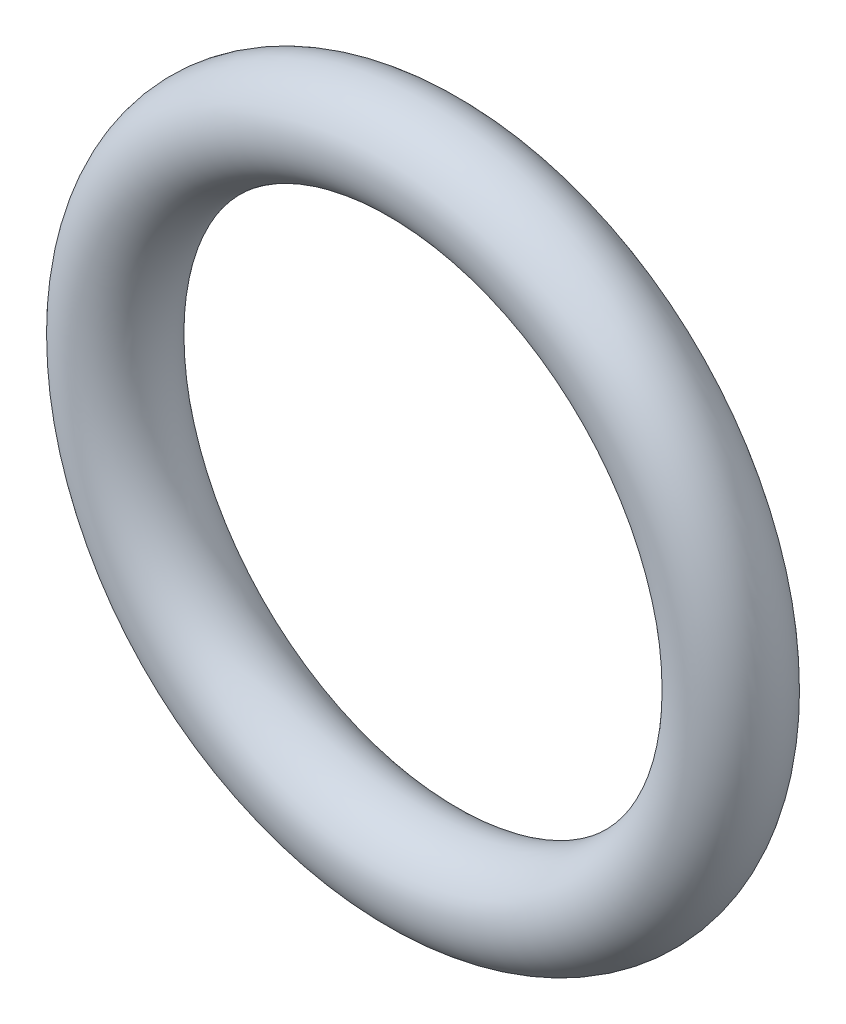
ISO-10303-21;
HEADER;
FILE_DESCRIPTION(('STEP AP214'),'2;1');
FILE_NAME('part.step','',(''),(''),'','','');
FILE_SCHEMA(('AUTOMOTIVE_DESIGN { 1 0 10303 214 1 1 1 1 }'));
ENDSEC;
DATA;
#1=APPLICATION_CONTEXT('core data for automotive mechanical design processes');
#2=APPLICATION_PROTOCOL_DEFINITION('international standard','automotive_design',2000,#1);
#3=PRODUCT_CONTEXT('',#1,'mechanical');
#4=PRODUCT('Part','Part','',(#3));
#5=PRODUCT_RELATED_PRODUCT_CATEGORY('part','',(#4));
#6=PRODUCT_DEFINITION_FORMATION('','',#4);
#7=PRODUCT_DEFINITION_CONTEXT('part definition',#1,'design');
#8=PRODUCT_DEFINITION('design','',#6,#7);
#9=PRODUCT_DEFINITION_SHAPE('','',#8);
#10=(LENGTH_UNIT() NAMED_UNIT(*) SI_UNIT(.MILLI.,.METRE.));
#11=(NAMED_UNIT(*) PLANE_ANGLE_UNIT() SI_UNIT($,.RADIAN.));
#12=(NAMED_UNIT(*) SI_UNIT($,.STERADIAN.) SOLID_ANGLE_UNIT());
#13=UNCERTAINTY_MEASURE_WITH_UNIT(LENGTH_MEASURE(1.E-05),#10,'distance_accuracy_value','');
#14=(GEOMETRIC_REPRESENTATION_CONTEXT(3) GLOBAL_UNCERTAINTY_ASSIGNED_CONTEXT((#13)) GLOBAL_UNIT_ASSIGNED_CONTEXT((#10,
#11,#12)) REPRESENTATION_CONTEXT('',''));
#15=CARTESIAN_POINT('',(0.,0.,0.));
#16=DIRECTION('',(0.,0.,1.));
#17=DIRECTION('',(1.,0.,0.));
#18=AXIS2_PLACEMENT_3D('',#15,#16,#17);
#19=CARTESIAN_POINT('',(0.,0.,-49.25));
#20=DIRECTION('',(0.,0.,1.));
#21=DIRECTION('',(1.,0.,0.));
#22=AXIS2_PLACEMENT_3D('',#19,#20,#21);
#23=TOROIDAL_SURFACE('',#22,9.5,1.5);
#24=CARTESIAN_POINT('',(11.,0.,-49.25));
#25=VERTEX_POINT('',#24);
#26=VERTEX_LOOP('',#25);
#27=FACE_BOUND('',#26,.T.);
#28=ADVANCED_FACE('F31',(#27),#23,.T.);
#29=CLOSED_SHELL('',(#28));
#30=MANIFOLD_SOLID_BREP('B2',#29);
#31=ADVANCED_BREP_SHAPE_REPRESENTATION('',(#18,#30),#14);
#32=SHAPE_DEFINITION_REPRESENTATION(#9,#31);
ENDSEC;
END-ISO-10303-21;
